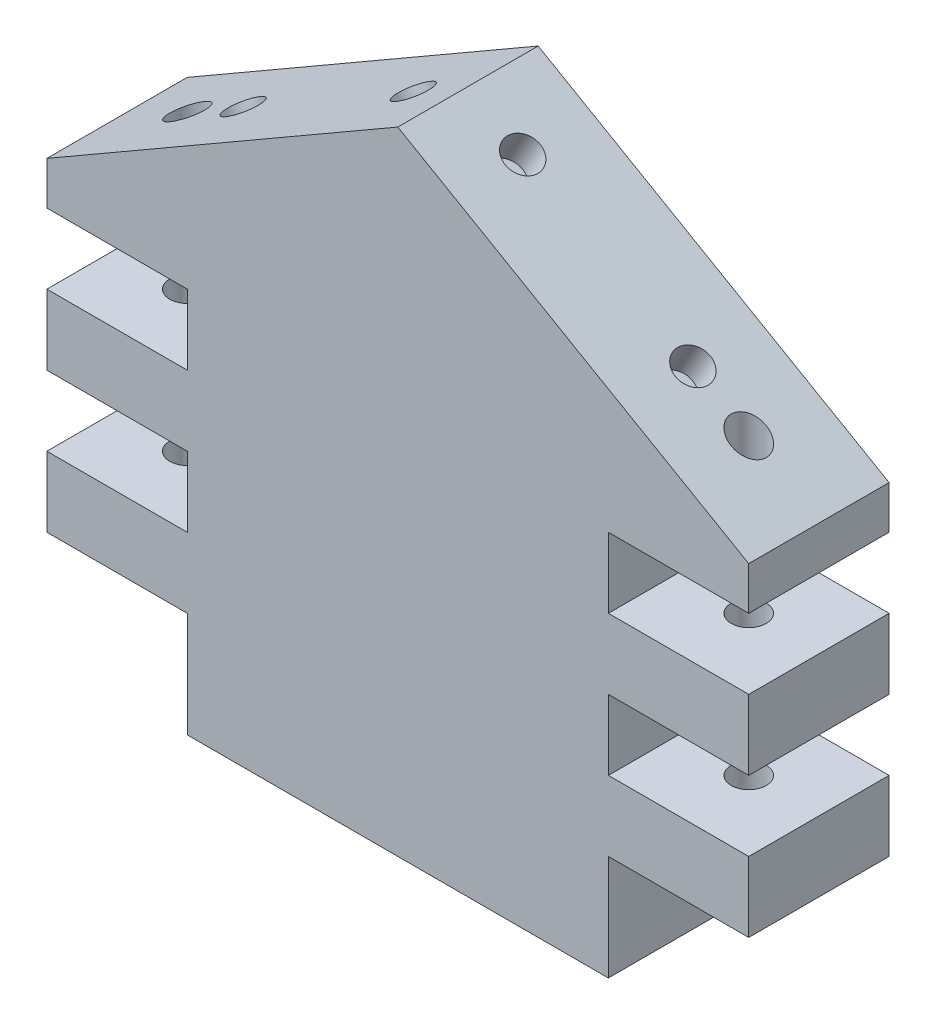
ISO-10303-21;
HEADER;
FILE_DESCRIPTION(('STEP AP214'),'2;1');
FILE_NAME('part.step','',(''),(''),'','','');
FILE_SCHEMA(('AUTOMOTIVE_DESIGN { 1 0 10303 214 1 1 1 1 }'));
ENDSEC;
DATA;
#1=APPLICATION_CONTEXT('core data for automotive mechanical design processes');
#2=APPLICATION_PROTOCOL_DEFINITION('international standard','automotive_design',2000,#1);
#3=PRODUCT_CONTEXT('',#1,'mechanical');
#4=PRODUCT('Part','Part','',(#3));
#5=PRODUCT_RELATED_PRODUCT_CATEGORY('part','',(#4));
#6=PRODUCT_DEFINITION_FORMATION('','',#4);
#7=PRODUCT_DEFINITION_CONTEXT('part definition',#1,'design');
#8=PRODUCT_DEFINITION('design','',#6,#7);
#9=PRODUCT_DEFINITION_SHAPE('','',#8);
#10=(LENGTH_UNIT() NAMED_UNIT(*) SI_UNIT(.MILLI.,.METRE.));
#11=(NAMED_UNIT(*) PLANE_ANGLE_UNIT() SI_UNIT($,.RADIAN.));
#12=(NAMED_UNIT(*) SI_UNIT($,.STERADIAN.) SOLID_ANGLE_UNIT());
#13=UNCERTAINTY_MEASURE_WITH_UNIT(LENGTH_MEASURE(1.E-05),#10,'distance_accuracy_value','');
#14=(GEOMETRIC_REPRESENTATION_CONTEXT(3) GLOBAL_UNCERTAINTY_ASSIGNED_CONTEXT((#13)) GLOBAL_UNIT_ASSIGNED_CONTEXT((#10,
#11,#12)) REPRESENTATION_CONTEXT('',''));
#15=CARTESIAN_POINT('',(0.,0.,0.));
#16=DIRECTION('',(0.,0.,1.));
#17=DIRECTION('',(1.,0.,0.));
#18=AXIS2_PLACEMENT_3D('',#15,#16,#17);
#19=CARTESIAN_POINT('',(-50.,16.1324865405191,-10.));
#20=DIRECTION('',(-0.499999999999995,0.866025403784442,0.));
#21=DIRECTION('',(-0.866025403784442,-0.499999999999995,0.));
#22=AXIS2_PLACEMENT_3D('',#19,#20,#21);
#23=PLANE('',#22);
#24=CARTESIAN_POINT('',(-7.79422863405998,40.5000000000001,0.));
#25=DIRECTION('',(0.499999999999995,-0.866025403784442,0.));
#26=DIRECTION('',(0.866025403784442,0.499999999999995,0.));
#27=AXIS2_PLACEMENT_3D('',#24,#25,#26);
#28=CIRCLE('',#27,2.5);
#29=CARTESIAN_POINT('',(-5.62916512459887,41.75,0.));
#30=VERTEX_POINT('',#29);
#31=EDGE_CURVE('E765',#30,#30,#28,.T.);
#32=ORIENTED_EDGE('',*,*,#31,.T.);
#33=EDGE_LOOP('',(#32));
#34=FACE_BOUND('',#33,.T.);
#35=DIRECTION('',(-0.866025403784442,-0.499999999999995,0.));
#36=VECTOR('',#35,1.);
#37=CARTESIAN_POINT('',(-50.,16.1324865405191,10.));
#38=LINE('',#37,#36);
#39=CARTESIAN_POINT('',(0.,45.,10.));
#40=VERTEX_POINT('',#39);
#41=CARTESIAN_POINT('',(-50.,16.1324865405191,10.));
#42=VERTEX_POINT('',#41);
#43=EDGE_CURVE('E213',#40,#42,#38,.T.);
#44=ORIENTED_EDGE('',*,*,#43,.F.);
#45=DIRECTION('',(0.,0.,1.));
#46=VECTOR('',#45,1.);
#47=CARTESIAN_POINT('',(0.,45.,-10.));
#48=LINE('',#47,#46);
#49=CARTESIAN_POINT('',(0.,45.,-10.));
#50=VERTEX_POINT('',#49);
#51=EDGE_CURVE('E208',#50,#40,#48,.T.);
#52=ORIENTED_EDGE('',*,*,#51,.F.);
#53=DIRECTION('',(-0.866025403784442,-0.499999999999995,0.));
#54=VECTOR('',#53,1.);
#55=CARTESIAN_POINT('',(-50.,16.1324865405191,-10.));
#56=LINE('',#55,#54);
#57=CARTESIAN_POINT('',(-50.,16.1324865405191,-10.));
#58=VERTEX_POINT('',#57);
#59=EDGE_CURVE('E202',#50,#58,#56,.T.);
#60=ORIENTED_EDGE('',*,*,#59,.T.);
#61=DIRECTION('',(0.,0.,1.));
#62=VECTOR('',#61,1.);
#63=CARTESIAN_POINT('',(-50.,16.1324865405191,-10.));
#64=LINE('',#63,#62);
#65=EDGE_CURVE('E205',#58,#42,#64,.T.);
#66=ORIENTED_EDGE('',*,*,#65,.T.);
#67=EDGE_LOOP('',(#44,#52,#60,#66));
#68=FACE_BOUND('',#67,.T.);
#69=CARTESIAN_POINT('',(-40.,21.9059892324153,0.));
#70=DIRECTION('',(-0.499999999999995,0.866025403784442,0.));
#71=DIRECTION('',(-0.866025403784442,-0.499999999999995,0.));
#72=AXIS2_PLACEMENT_3D('',#69,#70,#71);
#73=ELLIPSE('',#72,2.88675134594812,2.5);
#74=CARTESIAN_POINT('',(-42.5,20.4626135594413,0.));
#75=VERTEX_POINT('',#74);
#76=EDGE_CURVE('E37',#75,#75,#73,.F.);
#77=ORIENTED_EDGE('',*,*,#76,.T.);
#78=EDGE_LOOP('',(#77));
#79=FACE_BOUND('',#78,.T.);
#80=CARTESIAN_POINT('',(-32.0429399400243,26.5000000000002,0.));
#81=DIRECTION('',(0.499999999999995,-0.866025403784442,0.));
#82=DIRECTION('',(0.866025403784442,0.499999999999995,0.));
#83=AXIS2_PLACEMENT_3D('',#80,#81,#82);
#84=CIRCLE('',#83,2.5);
#85=CARTESIAN_POINT('',(-29.8778764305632,27.7500000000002,0.));
#86=VERTEX_POINT('',#85);
#87=EDGE_CURVE('E766',#86,#86,#84,.T.);
#88=ORIENTED_EDGE('',*,*,#87,.T.);
#89=EDGE_LOOP('',(#88));
#90=FACE_BOUND('',#89,.T.);
#91=ADVANCED_FACE('F33',(#34,#68,#79,#90),#23,.T.);
#92=CARTESIAN_POINT('',(-50.,-45.,10.));
#93=DIRECTION('',(1.,0.,0.));
#94=DIRECTION('',(0.,0.,-1.));
#95=AXIS2_PLACEMENT_3D('',#92,#93,#94);
#96=PLANE('',#95);
#97=ORIENTED_EDGE('',*,*,#65,.F.);
#98=DIRECTION('',(0.,-1.,0.));
#99=VECTOR('',#98,1.);
#100=CARTESIAN_POINT('',(-50.,-45.,-10.));
#101=LINE('',#100,#99);
#102=CARTESIAN_POINT('',(-50.,10.,-10.));
#103=VERTEX_POINT('',#102);
#104=EDGE_CURVE('E218',#58,#103,#101,.T.);
#105=ORIENTED_EDGE('',*,*,#104,.T.);
#106=DIRECTION('',(0.,0.,1.));
#107=VECTOR('',#106,1.);
#108=CARTESIAN_POINT('',(-50.,10.,-10.));
#109=LINE('',#108,#107);
#110=CARTESIAN_POINT('',(-50.,10.,10.));
#111=VERTEX_POINT('',#110);
#112=EDGE_CURVE('E491',#103,#111,#109,.T.);
#113=ORIENTED_EDGE('',*,*,#112,.T.);
#114=DIRECTION('',(0.,-1.,0.));
#115=VECTOR('',#114,1.);
#116=CARTESIAN_POINT('',(-50.,-45.,10.));
#117=LINE('',#116,#115);
#118=EDGE_CURVE('E220',#42,#111,#117,.T.);
#119=ORIENTED_EDGE('',*,*,#118,.F.);
#120=EDGE_LOOP('',(#97,#105,#113,#119));
#121=FACE_BOUND('',#120,.T.);
#122=ADVANCED_FACE('F35',(#121),#96,.F.);
#123=CARTESIAN_POINT('',(0.,0.,10.));
#124=DIRECTION('',(0.,0.,1.));
#125=DIRECTION('',(1.,0.,0.));
#126=AXIS2_PLACEMENT_3D('',#123,#124,#125);
#127=PLANE('',#126);
#128=DIRECTION('',(0.866025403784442,-0.499999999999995,0.));
#129=VECTOR('',#128,1.);
#130=CARTESIAN_POINT('',(50.,16.1324865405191,10.));
#131=LINE('',#130,#129);
#132=CARTESIAN_POINT('',(50.,16.1324865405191,10.));
#133=VERTEX_POINT('',#132);
#134=EDGE_CURVE('E440',#40,#133,#131,.T.);
#135=ORIENTED_EDGE('',*,*,#134,.F.);
#136=ORIENTED_EDGE('',*,*,#43,.T.);
#137=ORIENTED_EDGE('',*,*,#118,.T.);
#138=DIRECTION('',(1.,0.,0.));
#139=VECTOR('',#138,1.);
#140=CARTESIAN_POINT('',(-50.,10.,10.));
#141=LINE('',#140,#139);
#142=CARTESIAN_POINT('',(-30.,9.99999999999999,10.));
#143=VERTEX_POINT('',#142);
#144=EDGE_CURVE('E482',#111,#143,#141,.T.);
#145=ORIENTED_EDGE('',*,*,#144,.T.);
#146=DIRECTION('',(0.,-1.,0.));
#147=VECTOR('',#146,1.);
#148=CARTESIAN_POINT('',(-30.,9.99999999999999,10.));
#149=LINE('',#148,#147);
#150=CARTESIAN_POINT('',(-30.,0.,10.));
#151=VERTEX_POINT('',#150);
#152=EDGE_CURVE('E487',#143,#151,#149,.T.);
#153=ORIENTED_EDGE('',*,*,#152,.T.);
#154=DIRECTION('',(-1.,0.,0.));
#155=VECTOR('',#154,1.);
#156=CARTESIAN_POINT('',(-50.,0.,10.));
#157=LINE('',#156,#155);
#158=CARTESIAN_POINT('',(-50.,0.,10.));
#159=VERTEX_POINT('',#158);
#160=EDGE_CURVE('E403',#151,#159,#157,.T.);
#161=ORIENTED_EDGE('',*,*,#160,.T.);
#162=CARTESIAN_POINT('',(-50.,-10.,10.));
#163=VERTEX_POINT('',#162);
#164=EDGE_CURVE('E254',#159,#163,#117,.T.);
#165=ORIENTED_EDGE('',*,*,#164,.T.);
#166=DIRECTION('',(1.,0.,0.));
#167=VECTOR('',#166,1.);
#168=CARTESIAN_POINT('',(-50.,-10.,10.));
#169=LINE('',#168,#167);
#170=CARTESIAN_POINT('',(-30.,-10.,10.));
#171=VERTEX_POINT('',#170);
#172=EDGE_CURVE('E401',#163,#171,#169,.T.);
#173=ORIENTED_EDGE('',*,*,#172,.T.);
#174=DIRECTION('',(0.,-1.,0.));
#175=VECTOR('',#174,1.);
#176=CARTESIAN_POINT('',(-30.,-10.,10.));
#177=LINE('',#176,#175);
#178=CARTESIAN_POINT('',(-30.,-20.,10.));
#179=VERTEX_POINT('',#178);
#180=EDGE_CURVE('E416',#171,#179,#177,.T.);
#181=ORIENTED_EDGE('',*,*,#180,.T.);
#182=DIRECTION('',(-1.,0.,0.));
#183=VECTOR('',#182,1.);
#184=CARTESIAN_POINT('',(-50.,-20.,10.));
#185=LINE('',#184,#183);
#186=CARTESIAN_POINT('',(-50.,-20.,10.));
#187=VERTEX_POINT('',#186);
#188=EDGE_CURVE('E493',#179,#187,#185,.T.);
#189=ORIENTED_EDGE('',*,*,#188,.T.);
#190=CARTESIAN_POINT('',(-50.,-30.,10.));
#191=VERTEX_POINT('',#190);
#192=EDGE_CURVE('E255',#187,#191,#117,.T.);
#193=ORIENTED_EDGE('',*,*,#192,.T.);
#194=DIRECTION('',(1.,0.,0.));
#195=VECTOR('',#194,1.);
#196=CARTESIAN_POINT('',(-50.,-30.,10.));
#197=LINE('',#196,#195);
#198=CARTESIAN_POINT('',(-30.,-30.,10.));
#199=VERTEX_POINT('',#198);
#200=EDGE_CURVE('E422',#191,#199,#197,.T.);
#201=ORIENTED_EDGE('',*,*,#200,.T.);
#202=DIRECTION('',(0.,-1.,0.));
#203=VECTOR('',#202,1.);
#204=CARTESIAN_POINT('',(-30.,-30.,10.));
#205=LINE('',#204,#203);
#206=CARTESIAN_POINT('',(-30.,-45.,10.));
#207=VERTEX_POINT('',#206);
#208=EDGE_CURVE('E420',#199,#207,#205,.T.);
#209=ORIENTED_EDGE('',*,*,#208,.T.);
#210=DIRECTION('',(1.,0.,0.));
#211=VECTOR('',#210,1.);
#212=CARTESIAN_POINT('',(50.,-45.,10.));
#213=LINE('',#212,#211);
#214=CARTESIAN_POINT('',(30.,-45.,10.));
#215=VERTEX_POINT('',#214);
#216=EDGE_CURVE('E253',#207,#215,#213,.T.);
#217=ORIENTED_EDGE('',*,*,#216,.T.);
#218=DIRECTION('',(0.,-1.,0.));
#219=VECTOR('',#218,1.);
#220=CARTESIAN_POINT('',(30.,-30.,10.));
#221=LINE('',#220,#219);
#222=CARTESIAN_POINT('',(30.,-30.,10.));
#223=VERTEX_POINT('',#222);
#224=EDGE_CURVE('E247',#223,#215,#221,.T.);
#225=ORIENTED_EDGE('',*,*,#224,.F.);
#226=DIRECTION('',(-1.,0.,0.));
#227=VECTOR('',#226,1.);
#228=CARTESIAN_POINT('',(50.,-30.,10.));
#229=LINE('',#228,#227);
#230=CARTESIAN_POINT('',(50.,-30.,10.));
#231=VERTEX_POINT('',#230);
#232=EDGE_CURVE('E315',#231,#223,#229,.T.);
#233=ORIENTED_EDGE('',*,*,#232,.F.);
#234=DIRECTION('',(0.,1.,0.));
#235=VECTOR('',#234,1.);
#236=CARTESIAN_POINT('',(50.,-45.,10.));
#237=LINE('',#236,#235);
#238=CARTESIAN_POINT('',(50.,-20.,10.));
#239=VERTEX_POINT('',#238);
#240=EDGE_CURVE('E11',#231,#239,#237,.T.);
#241=ORIENTED_EDGE('',*,*,#240,.T.);
#242=DIRECTION('',(1.,0.,0.));
#243=VECTOR('',#242,1.);
#244=CARTESIAN_POINT('',(50.,-20.,10.));
#245=LINE('',#244,#243);
#246=CARTESIAN_POINT('',(30.,-20.,10.));
#247=VERTEX_POINT('',#246);
#248=EDGE_CURVE('E303',#247,#239,#245,.T.);
#249=ORIENTED_EDGE('',*,*,#248,.F.);
#250=DIRECTION('',(0.,-1.,0.));
#251=VECTOR('',#250,1.);
#252=CARTESIAN_POINT('',(30.,-10.,10.));
#253=LINE('',#252,#251);
#254=CARTESIAN_POINT('',(30.,-10.,10.));
#255=VERTEX_POINT('',#254);
#256=EDGE_CURVE('E288',#255,#247,#253,.T.);
#257=ORIENTED_EDGE('',*,*,#256,.F.);
#258=DIRECTION('',(-1.,0.,0.));
#259=VECTOR('',#258,1.);
#260=CARTESIAN_POINT('',(50.,-10.,10.));
#261=LINE('',#260,#259);
#262=CARTESIAN_POINT('',(50.,-10.,10.));
#263=VERTEX_POINT('',#262);
#264=EDGE_CURVE('E273',#263,#255,#261,.T.);
#265=ORIENTED_EDGE('',*,*,#264,.F.);
#266=CARTESIAN_POINT('',(50.,0.,10.));
#267=VERTEX_POINT('',#266);
#268=EDGE_CURVE('E42',#263,#267,#237,.T.);
#269=ORIENTED_EDGE('',*,*,#268,.T.);
#270=DIRECTION('',(1.,0.,0.));
#271=VECTOR('',#270,1.);
#272=CARTESIAN_POINT('',(50.,0.,10.));
#273=LINE('',#272,#271);
#274=CARTESIAN_POINT('',(30.,0.,10.));
#275=VERTEX_POINT('',#274);
#276=EDGE_CURVE('E270',#275,#267,#273,.T.);
#277=ORIENTED_EDGE('',*,*,#276,.F.);
#278=DIRECTION('',(0.,-1.,0.));
#279=VECTOR('',#278,1.);
#280=CARTESIAN_POINT('',(30.,9.99999999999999,10.));
#281=LINE('',#280,#279);
#282=CARTESIAN_POINT('',(30.,9.99999999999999,10.));
#283=VERTEX_POINT('',#282);
#284=EDGE_CURVE('E375',#283,#275,#281,.T.);
#285=ORIENTED_EDGE('',*,*,#284,.F.);
#286=DIRECTION('',(-1.,0.,0.));
#287=VECTOR('',#286,1.);
#288=CARTESIAN_POINT('',(50.,10.,10.));
#289=LINE('',#288,#287);
#290=CARTESIAN_POINT('',(50.,10.,10.));
#291=VERTEX_POINT('',#290);
#292=EDGE_CURVE('E360',#291,#283,#289,.T.);
#293=ORIENTED_EDGE('',*,*,#292,.F.);
#294=EDGE_CURVE('E44',#291,#133,#237,.T.);
#295=ORIENTED_EDGE('',*,*,#294,.T.);
#296=EDGE_LOOP('',(#135,#136,#137,#145,#153,#161,#165,#173,#181,#189,#193,#201,#209,#217,#225,
#233,#241,#249,#257,#265,#269,#277,#285,#293,#295));
#297=FACE_BOUND('',#296,.T.);
#298=ADVANCED_FACE('F268',(#297),#127,.T.);
#299=CARTESIAN_POINT('',(0.,0.,-10.));
#300=DIRECTION('',(0.,0.,1.));
#301=DIRECTION('',(1.,0.,0.));
#302=AXIS2_PLACEMENT_3D('',#299,#300,#301);
#303=PLANE('',#302);
#304=ORIENTED_EDGE('',*,*,#59,.F.);
#305=DIRECTION('',(0.866025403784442,-0.499999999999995,0.));
#306=VECTOR('',#305,1.);
#307=CARTESIAN_POINT('',(50.,16.1324865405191,-10.));
#308=LINE('',#307,#306);
#309=CARTESIAN_POINT('',(50.,16.1324865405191,-10.));
#310=VERTEX_POINT('',#309);
#311=EDGE_CURVE('E387',#50,#310,#308,.T.);
#312=ORIENTED_EDGE('',*,*,#311,.T.);
#313=DIRECTION('',(0.,1.,0.));
#314=VECTOR('',#313,1.);
#315=CARTESIAN_POINT('',(50.,-45.,-10.));
#316=LINE('',#315,#314);
#317=CARTESIAN_POINT('',(50.,10.,-10.));
#318=VERTEX_POINT('',#317);
#319=EDGE_CURVE('E230',#318,#310,#316,.T.);
#320=ORIENTED_EDGE('',*,*,#319,.F.);
#321=DIRECTION('',(-1.,0.,0.));
#322=VECTOR('',#321,1.);
#323=CARTESIAN_POINT('',(50.,10.,-10.));
#324=LINE('',#323,#322);
#325=CARTESIAN_POINT('',(30.,9.99999999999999,-10.));
#326=VERTEX_POINT('',#325);
#327=EDGE_CURVE('E367',#318,#326,#324,.T.);
#328=ORIENTED_EDGE('',*,*,#327,.T.);
#329=DIRECTION('',(0.,-1.,0.));
#330=VECTOR('',#329,1.);
#331=CARTESIAN_POINT('',(30.,9.99999999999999,-10.));
#332=LINE('',#331,#330);
#333=CARTESIAN_POINT('',(30.,0.,-10.));
#334=VERTEX_POINT('',#333);
#335=EDGE_CURVE('E370',#326,#334,#332,.T.);
#336=ORIENTED_EDGE('',*,*,#335,.T.);
#337=DIRECTION('',(1.,0.,0.));
#338=VECTOR('',#337,1.);
#339=CARTESIAN_POINT('',(50.,0.,-10.));
#340=LINE('',#339,#338);
#341=CARTESIAN_POINT('',(50.,0.,-10.));
#342=VERTEX_POINT('',#341);
#343=EDGE_CURVE('E298',#334,#342,#340,.T.);
#344=ORIENTED_EDGE('',*,*,#343,.T.);
#345=CARTESIAN_POINT('',(50.,-10.,-10.));
#346=VERTEX_POINT('',#345);
#347=EDGE_CURVE('E282',#346,#342,#316,.T.);
#348=ORIENTED_EDGE('',*,*,#347,.F.);
#349=DIRECTION('',(-1.,0.,0.));
#350=VECTOR('',#349,1.);
#351=CARTESIAN_POINT('',(50.,-10.,-10.));
#352=LINE('',#351,#350);
#353=CARTESIAN_POINT('',(30.,-10.,-10.));
#354=VERTEX_POINT('',#353);
#355=EDGE_CURVE('E299',#346,#354,#352,.T.);
#356=ORIENTED_EDGE('',*,*,#355,.T.);
#357=DIRECTION('',(0.,-1.,0.));
#358=VECTOR('',#357,1.);
#359=CARTESIAN_POINT('',(30.,-10.,-10.));
#360=LINE('',#359,#358);
#361=CARTESIAN_POINT('',(30.,-20.,-10.));
#362=VERTEX_POINT('',#361);
#363=EDGE_CURVE('E302',#354,#362,#360,.T.);
#364=ORIENTED_EDGE('',*,*,#363,.T.);
#365=DIRECTION('',(1.,0.,0.));
#366=VECTOR('',#365,1.);
#367=CARTESIAN_POINT('',(50.,-20.,-10.));
#368=LINE('',#367,#366);
#369=CARTESIAN_POINT('',(50.,-20.,-10.));
#370=VERTEX_POINT('',#369);
#371=EDGE_CURVE('E306',#362,#370,#368,.T.);
#372=ORIENTED_EDGE('',*,*,#371,.T.);
#373=CARTESIAN_POINT('',(50.,-30.,-10.));
#374=VERTEX_POINT('',#373);
#375=EDGE_CURVE('E338',#374,#370,#316,.T.);
#376=ORIENTED_EDGE('',*,*,#375,.F.);
#377=DIRECTION('',(-1.,0.,0.));
#378=VECTOR('',#377,1.);
#379=CARTESIAN_POINT('',(50.,-30.,-10.));
#380=LINE('',#379,#378);
#381=CARTESIAN_POINT('',(30.,-30.,-10.));
#382=VERTEX_POINT('',#381);
#383=EDGE_CURVE('E321',#374,#382,#380,.T.);
#384=ORIENTED_EDGE('',*,*,#383,.T.);
#385=DIRECTION('',(0.,-1.,0.));
#386=VECTOR('',#385,1.);
#387=CARTESIAN_POINT('',(30.,-30.,-10.));
#388=LINE('',#387,#386);
#389=CARTESIAN_POINT('',(30.,-45.,-10.));
#390=VERTEX_POINT('',#389);
#391=EDGE_CURVE('E251',#382,#390,#388,.T.);
#392=ORIENTED_EDGE('',*,*,#391,.T.);
#393=DIRECTION('',(1.,0.,0.));
#394=VECTOR('',#393,1.);
#395=CARTESIAN_POINT('',(50.,-45.,-10.));
#396=LINE('',#395,#394);
#397=CARTESIAN_POINT('',(-30.,-45.,-10.));
#398=VERTEX_POINT('',#397);
#399=EDGE_CURVE('E226',#398,#390,#396,.T.);
#400=ORIENTED_EDGE('',*,*,#399,.F.);
#401=DIRECTION('',(0.,-1.,0.));
#402=VECTOR('',#401,1.);
#403=CARTESIAN_POINT('',(-30.,-30.,-10.));
#404=LINE('',#403,#402);
#405=CARTESIAN_POINT('',(-30.,-30.,-10.));
#406=VERTEX_POINT('',#405);
#407=EDGE_CURVE('E431',#406,#398,#404,.T.);
#408=ORIENTED_EDGE('',*,*,#407,.F.);
#409=DIRECTION('',(1.,0.,0.));
#410=VECTOR('',#409,1.);
#411=CARTESIAN_POINT('',(-50.,-30.,-10.));
#412=LINE('',#411,#410);
#413=CARTESIAN_POINT('',(-50.,-30.,-10.));
#414=VERTEX_POINT('',#413);
#415=EDGE_CURVE('E433',#414,#406,#412,.T.);
#416=ORIENTED_EDGE('',*,*,#415,.F.);
#417=CARTESIAN_POINT('',(-50.,-20.,-10.));
#418=VERTEX_POINT('',#417);
#419=EDGE_CURVE('E229',#418,#414,#101,.T.);
#420=ORIENTED_EDGE('',*,*,#419,.F.);
#421=DIRECTION('',(-1.,0.,0.));
#422=VECTOR('',#421,1.);
#423=CARTESIAN_POINT('',(-50.,-20.,-10.));
#424=LINE('',#423,#422);
#425=CARTESIAN_POINT('',(-30.,-20.,-10.));
#426=VERTEX_POINT('',#425);
#427=EDGE_CURVE('E415',#426,#418,#424,.T.);
#428=ORIENTED_EDGE('',*,*,#427,.F.);
#429=DIRECTION('',(0.,-1.,0.));
#430=VECTOR('',#429,1.);
#431=CARTESIAN_POINT('',(-30.,-10.,-10.));
#432=LINE('',#431,#430);
#433=CARTESIAN_POINT('',(-30.,-10.,-10.));
#434=VERTEX_POINT('',#433);
#435=EDGE_CURVE('E499',#434,#426,#432,.T.);
#436=ORIENTED_EDGE('',*,*,#435,.F.);
#437=DIRECTION('',(1.,0.,0.));
#438=VECTOR('',#437,1.);
#439=CARTESIAN_POINT('',(-50.,-10.,-10.));
#440=LINE('',#439,#438);
#441=CARTESIAN_POINT('',(-50.,-10.,-10.));
#442=VERTEX_POINT('',#441);
#443=EDGE_CURVE('E430',#442,#434,#440,.T.);
#444=ORIENTED_EDGE('',*,*,#443,.F.);
#445=CARTESIAN_POINT('',(-50.,0.,-10.));
#446=VERTEX_POINT('',#445);
#447=EDGE_CURVE('E227',#446,#442,#101,.T.);
#448=ORIENTED_EDGE('',*,*,#447,.F.);
#449=DIRECTION('',(-1.,0.,0.));
#450=VECTOR('',#449,1.);
#451=CARTESIAN_POINT('',(-50.,0.,-10.));
#452=LINE('',#451,#450);
#453=CARTESIAN_POINT('',(-30.,0.,-10.));
#454=VERTEX_POINT('',#453);
#455=EDGE_CURVE('E479',#454,#446,#452,.T.);
#456=ORIENTED_EDGE('',*,*,#455,.F.);
#457=DIRECTION('',(0.,-1.,0.));
#458=VECTOR('',#457,1.);
#459=CARTESIAN_POINT('',(-30.,9.99999999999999,-10.));
#460=LINE('',#459,#458);
#461=CARTESIAN_POINT('',(-30.,9.99999999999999,-10.));
#462=VERTEX_POINT('',#461);
#463=EDGE_CURVE('E481',#462,#454,#460,.T.);
#464=ORIENTED_EDGE('',*,*,#463,.F.);
#465=DIRECTION('',(1.,0.,0.));
#466=VECTOR('',#465,1.);
#467=CARTESIAN_POINT('',(-50.,10.,-10.));
#468=LINE('',#467,#466);
#469=EDGE_CURVE('E225',#103,#462,#468,.T.);
#470=ORIENTED_EDGE('',*,*,#469,.F.);
#471=ORIENTED_EDGE('',*,*,#104,.F.);
#472=EDGE_LOOP('',(#304,#312,#320,#328,#336,#344,#348,#356,#364,#372,#376,#384,#392,#400,#408,
#416,#420,#428,#436,#444,#448,#456,#464,#470,#471));
#473=FACE_BOUND('',#472,.T.);
#474=ADVANCED_FACE('F223',(#473),#303,.F.);
#475=CARTESIAN_POINT('',(-40.,45.,0.));
#476=DIRECTION('',(0.,-1.,0.));
#477=DIRECTION('',(1.,0.,0.));
#478=AXIS2_PLACEMENT_3D('',#475,#476,#477);
#479=CYLINDRICAL_SURFACE('',#478,2.5);
#480=CARTESIAN_POINT('',(-40.,10.,0.));
#481=DIRECTION('',(0.,-1.,0.));
#482=DIRECTION('',(1.,0.,0.));
#483=AXIS2_PLACEMENT_3D('',#480,#481,#482);
#484=CIRCLE('',#483,2.5);
#485=CARTESIAN_POINT('',(-37.5,10.,0.));
#486=VERTEX_POINT('',#485);
#487=EDGE_CURVE('E460',#486,#486,#484,.T.);
#488=ORIENTED_EDGE('',*,*,#487,.T.);
#489=EDGE_LOOP('',(#488));
#490=FACE_BOUND('',#489,.T.);
#491=ORIENTED_EDGE('',*,*,#76,.F.);
#492=EDGE_LOOP('',(#491));
#493=FACE_BOUND('',#492,.T.);
#494=ADVANCED_FACE('F545',(#490,#493),#479,.F.);
#495=DIRECTION('',(0.,0.,1.));
#496=VECTOR('',#495,1.);
#497=CARTESIAN_POINT('',(-50.,0.,-10.));
#498=LINE('',#497,#496);
#499=EDGE_CURVE('E485',#446,#159,#498,.T.);
#500=ORIENTED_EDGE('',*,*,#499,.F.);
#501=ORIENTED_EDGE('',*,*,#447,.T.);
#502=DIRECTION('',(0.,0.,1.));
#503=VECTOR('',#502,1.);
#504=CARTESIAN_POINT('',(-50.,-10.,-10.));
#505=LINE('',#504,#503);
#506=EDGE_CURVE('E410',#442,#163,#505,.T.);
#507=ORIENTED_EDGE('',*,*,#506,.T.);
#508=ORIENTED_EDGE('',*,*,#164,.F.);
#509=EDGE_LOOP('',(#500,#501,#507,#508));
#510=FACE_BOUND('',#509,.T.);
#511=ADVANCED_FACE('F418',(#510),#96,.F.);
#512=DIRECTION('',(0.,0.,1.));
#513=VECTOR('',#512,1.);
#514=CARTESIAN_POINT('',(-50.,-20.,-10.));
#515=LINE('',#514,#513);
#516=EDGE_CURVE('E428',#418,#187,#515,.T.);
#517=ORIENTED_EDGE('',*,*,#516,.F.);
#518=ORIENTED_EDGE('',*,*,#419,.T.);
#519=DIRECTION('',(0.,0.,1.));
#520=VECTOR('',#519,1.);
#521=CARTESIAN_POINT('',(-50.,-30.,-10.));
#522=LINE('',#521,#520);
#523=EDGE_CURVE('E438',#414,#191,#522,.T.);
#524=ORIENTED_EDGE('',*,*,#523,.T.);
#525=ORIENTED_EDGE('',*,*,#192,.F.);
#526=EDGE_LOOP('',(#517,#518,#524,#525));
#527=FACE_BOUND('',#526,.T.);
#528=ADVANCED_FACE('F507',(#527),#96,.F.);
#529=CARTESIAN_POINT('',(50.,-45.,10.));
#530=DIRECTION('',(0.,1.,0.));
#531=DIRECTION('',(-1.,0.,0.));
#532=AXIS2_PLACEMENT_3D('',#529,#530,#531);
#533=PLANE('',#532);
#534=DIRECTION('',(0.,0.,1.));
#535=VECTOR('',#534,1.);
#536=CARTESIAN_POINT('',(-30.,-45.,-10.));
#537=LINE('',#536,#535);
#538=EDGE_CURVE('E435',#398,#207,#537,.T.);
#539=ORIENTED_EDGE('',*,*,#538,.F.);
#540=ORIENTED_EDGE('',*,*,#399,.T.);
#541=DIRECTION('',(0.,0.,1.));
#542=VECTOR('',#541,1.);
#543=CARTESIAN_POINT('',(30.,-45.,-10.));
#544=LINE('',#543,#542);
#545=EDGE_CURVE('E232',#390,#215,#544,.T.);
#546=ORIENTED_EDGE('',*,*,#545,.T.);
#547=ORIENTED_EDGE('',*,*,#216,.F.);
#548=EDGE_LOOP('',(#539,#540,#546,#547));
#549=FACE_BOUND('',#548,.T.);
#550=ADVANCED_FACE('F516',(#549),#533,.F.);
#551=CARTESIAN_POINT('',(50.,-30.,-10.));
#552=DIRECTION('',(0.,1.,0.));
#553=DIRECTION('',(0.,0.,1.));
#554=AXIS2_PLACEMENT_3D('',#551,#552,#553);
#555=PLANE('',#554);
#556=ORIENTED_EDGE('',*,*,#232,.T.);
#557=DIRECTION('',(0.,0.,1.));
#558=VECTOR('',#557,1.);
#559=CARTESIAN_POINT('',(30.,-30.,-10.));
#560=LINE('',#559,#558);
#561=EDGE_CURVE('E239',#382,#223,#560,.T.);
#562=ORIENTED_EDGE('',*,*,#561,.F.);
#563=ORIENTED_EDGE('',*,*,#383,.F.);
#564=DIRECTION('',(0.,0.,1.));
#565=VECTOR('',#564,1.);
#566=CARTESIAN_POINT('',(50.,-30.,-10.));
#567=LINE('',#566,#565);
#568=EDGE_CURVE('E244',#374,#231,#567,.T.);
#569=ORIENTED_EDGE('',*,*,#568,.T.);
#570=EDGE_LOOP('',(#556,#562,#563,#569));
#571=FACE_BOUND('',#570,.T.);
#572=CARTESIAN_POINT('',(40.,-30.,0.));
#573=DIRECTION('',(0.,1.,0.));
#574=DIRECTION('',(-1.,0.,0.));
#575=AXIS2_PLACEMENT_3D('',#572,#573,#574);
#576=CIRCLE('',#575,2.5);
#577=CARTESIAN_POINT('',(37.5,-30.,0.));
#578=VERTEX_POINT('',#577);
#579=EDGE_CURVE('E449',#578,#578,#576,.T.);
#580=ORIENTED_EDGE('',*,*,#579,.T.);
#581=EDGE_LOOP('',(#580));
#582=FACE_BOUND('',#581,.T.);
#583=ADVANCED_FACE('F517',(#571,#582),#555,.F.);
#584=CARTESIAN_POINT('',(50.,-20.,-10.));
#585=DIRECTION('',(0.,-1.,0.));
#586=DIRECTION('',(0.,0.,-1.));
#587=AXIS2_PLACEMENT_3D('',#584,#585,#586);
#588=PLANE('',#587);
#589=ORIENTED_EDGE('',*,*,#248,.T.);
#590=DIRECTION('',(0.,0.,1.));
#591=VECTOR('',#590,1.);
#592=CARTESIAN_POINT('',(50.,-20.,-10.));
#593=LINE('',#592,#591);
#594=EDGE_CURVE('E312',#370,#239,#593,.T.);
#595=ORIENTED_EDGE('',*,*,#594,.F.);
#596=ORIENTED_EDGE('',*,*,#371,.F.);
#597=DIRECTION('',(0.,0.,1.));
#598=VECTOR('',#597,1.);
#599=CARTESIAN_POINT('',(30.,-20.,-10.));
#600=LINE('',#599,#598);
#601=EDGE_CURVE('E316',#362,#247,#600,.T.);
#602=ORIENTED_EDGE('',*,*,#601,.T.);
#603=EDGE_LOOP('',(#589,#595,#596,#602));
#604=FACE_BOUND('',#603,.T.);
#605=CARTESIAN_POINT('',(40.,-20.,0.));
#606=DIRECTION('',(0.,-1.,0.));
#607=DIRECTION('',(0.,0.,-1.));
#608=AXIS2_PLACEMENT_3D('',#605,#606,#607);
#609=CIRCLE('',#608,2.5);
#610=CARTESIAN_POINT('',(40.,-20.,-2.5));
#611=VERTEX_POINT('',#610);
#612=EDGE_CURVE('E356',#611,#611,#609,.F.);
#613=ORIENTED_EDGE('',*,*,#612,.F.);
#614=EDGE_LOOP('',(#613));
#615=FACE_BOUND('',#614,.T.);
#616=ADVANCED_FACE('F341',(#604,#615),#588,.F.);
#617=CARTESIAN_POINT('',(50.,-10.,-10.));
#618=DIRECTION('',(0.,1.,0.));
#619=DIRECTION('',(-1.,0.,0.));
#620=AXIS2_PLACEMENT_3D('',#617,#618,#619);
#621=PLANE('',#620);
#622=ORIENTED_EDGE('',*,*,#264,.T.);
#623=DIRECTION('',(0.,0.,1.));
#624=VECTOR('',#623,1.);
#625=CARTESIAN_POINT('',(30.,-10.,-10.));
#626=LINE('',#625,#624);
#627=EDGE_CURVE('E318',#354,#255,#626,.T.);
#628=ORIENTED_EDGE('',*,*,#627,.F.);
#629=ORIENTED_EDGE('',*,*,#355,.F.);
#630=DIRECTION('',(0.,0.,1.));
#631=VECTOR('',#630,1.);
#632=CARTESIAN_POINT('',(50.,-10.,-10.));
#633=LINE('',#632,#631);
#634=EDGE_CURVE('E279',#346,#263,#633,.T.);
#635=ORIENTED_EDGE('',*,*,#634,.T.);
#636=EDGE_LOOP('',(#622,#628,#629,#635));
#637=FACE_BOUND('',#636,.T.);
#638=CARTESIAN_POINT('',(40.,-10.,0.));
#639=DIRECTION('',(0.,1.,0.));
#640=DIRECTION('',(-1.,0.,0.));
#641=AXIS2_PLACEMENT_3D('',#638,#639,#640);
#642=CIRCLE('',#641,2.5);
#643=CARTESIAN_POINT('',(37.5,-10.,0.));
#644=VERTEX_POINT('',#643);
#645=EDGE_CURVE('E354',#644,#644,#642,.F.);
#646=ORIENTED_EDGE('',*,*,#645,.F.);
#647=EDGE_LOOP('',(#646));
#648=FACE_BOUND('',#647,.T.);
#649=ADVANCED_FACE('F347',(#637,#648),#621,.F.);
#650=CARTESIAN_POINT('',(50.,0.,-10.));
#651=DIRECTION('',(0.,-1.,0.));
#652=DIRECTION('',(0.,0.,-1.));
#653=AXIS2_PLACEMENT_3D('',#650,#651,#652);
#654=PLANE('',#653);
#655=ORIENTED_EDGE('',*,*,#276,.T.);
#656=DIRECTION('',(0.,0.,1.));
#657=VECTOR('',#656,1.);
#658=CARTESIAN_POINT('',(50.,0.,-10.));
#659=LINE('',#658,#657);
#660=EDGE_CURVE('E281',#342,#267,#659,.T.);
#661=ORIENTED_EDGE('',*,*,#660,.F.);
#662=ORIENTED_EDGE('',*,*,#343,.F.);
#663=DIRECTION('',(0.,0.,1.));
#664=VECTOR('',#663,1.);
#665=CARTESIAN_POINT('',(30.,0.,-10.));
#666=LINE('',#665,#664);
#667=EDGE_CURVE('E286',#334,#275,#666,.T.);
#668=ORIENTED_EDGE('',*,*,#667,.T.);
#669=EDGE_LOOP('',(#655,#661,#662,#668));
#670=FACE_BOUND('',#669,.T.);
#671=CARTESIAN_POINT('',(40.,0.,0.));
#672=DIRECTION('',(0.,-1.,0.));
#673=DIRECTION('',(0.,0.,-1.));
#674=AXIS2_PLACEMENT_3D('',#671,#672,#673);
#675=CIRCLE('',#674,2.5);
#676=CARTESIAN_POINT('',(40.,0.,-2.5));
#677=VERTEX_POINT('',#676);
#678=EDGE_CURVE('E357',#677,#677,#675,.F.);
#679=ORIENTED_EDGE('',*,*,#678,.F.);
#680=EDGE_LOOP('',(#679));
#681=FACE_BOUND('',#680,.T.);
#682=ADVANCED_FACE('F350',(#670,#681),#654,.F.);
#683=CARTESIAN_POINT('',(50.,10.,-10.));
#684=DIRECTION('',(0.,1.,0.));
#685=DIRECTION('',(-1.,0.,0.));
#686=AXIS2_PLACEMENT_3D('',#683,#684,#685);
#687=PLANE('',#686);
#688=ORIENTED_EDGE('',*,*,#292,.T.);
#689=DIRECTION('',(0.,0.,1.));
#690=VECTOR('',#689,1.);
#691=CARTESIAN_POINT('',(30.,9.99999999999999,-10.));
#692=LINE('',#691,#690);
#693=EDGE_CURVE('E290',#326,#283,#692,.T.);
#694=ORIENTED_EDGE('',*,*,#693,.F.);
#695=ORIENTED_EDGE('',*,*,#327,.F.);
#696=DIRECTION('',(0.,0.,1.));
#697=VECTOR('',#696,1.);
#698=CARTESIAN_POINT('',(50.,10.,-10.));
#699=LINE('',#698,#697);
#700=EDGE_CURVE('E296',#318,#291,#699,.T.);
#701=ORIENTED_EDGE('',*,*,#700,.T.);
#702=EDGE_LOOP('',(#688,#694,#695,#701));
#703=FACE_BOUND('',#702,.T.);
#704=CARTESIAN_POINT('',(40.,10.,0.));
#705=DIRECTION('',(0.,1.,0.));
#706=DIRECTION('',(-1.,0.,0.));
#707=AXIS2_PLACEMENT_3D('',#704,#705,#706);
#708=CIRCLE('',#707,2.5);
#709=CARTESIAN_POINT('',(37.5,10.,0.));
#710=VERTEX_POINT('',#709);
#711=EDGE_CURVE('E363',#710,#710,#708,.F.);
#712=ORIENTED_EDGE('',*,*,#711,.F.);
#713=EDGE_LOOP('',(#712));
#714=FACE_BOUND('',#713,.T.);
#715=ADVANCED_FACE('F382',(#703,#714),#687,.F.);
#716=CARTESIAN_POINT('',(50.,-45.,10.));
#717=DIRECTION('',(-1.,0.,0.));
#718=DIRECTION('',(0.,0.,1.));
#719=AXIS2_PLACEMENT_3D('',#716,#717,#718);
#720=PLANE('',#719);
#721=ORIENTED_EDGE('',*,*,#347,.T.);
#722=ORIENTED_EDGE('',*,*,#660,.T.);
#723=ORIENTED_EDGE('',*,*,#268,.F.);
#724=ORIENTED_EDGE('',*,*,#634,.F.);
#725=EDGE_LOOP('',(#721,#722,#723,#724));
#726=FACE_BOUND('',#725,.T.);
#727=ADVANCED_FACE('F278',(#726),#720,.F.);
#728=ORIENTED_EDGE('',*,*,#375,.T.);
#729=ORIENTED_EDGE('',*,*,#594,.T.);
#730=ORIENTED_EDGE('',*,*,#240,.F.);
#731=ORIENTED_EDGE('',*,*,#568,.F.);
#732=EDGE_LOOP('',(#728,#729,#730,#731));
#733=FACE_BOUND('',#732,.T.);
#734=ADVANCED_FACE('F336',(#733),#720,.F.);
#735=ORIENTED_EDGE('',*,*,#319,.T.);
#736=DIRECTION('',(0.,0.,1.));
#737=VECTOR('',#736,1.);
#738=CARTESIAN_POINT('',(50.,16.1324865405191,-10.));
#739=LINE('',#738,#737);
#740=EDGE_CURVE('E446',#310,#133,#739,.T.);
#741=ORIENTED_EDGE('',*,*,#740,.T.);
#742=ORIENTED_EDGE('',*,*,#294,.F.);
#743=ORIENTED_EDGE('',*,*,#700,.F.);
#744=EDGE_LOOP('',(#735,#741,#742,#743));
#745=FACE_BOUND('',#744,.T.);
#746=ADVANCED_FACE('F590',(#745),#720,.F.);
#747=CARTESIAN_POINT('',(30.,-30.,-10.));
#748=DIRECTION('',(-1.,0.,0.));
#749=DIRECTION('',(0.,-1.,0.));
#750=AXIS2_PLACEMENT_3D('',#747,#748,#749);
#751=PLANE('',#750);
#752=ORIENTED_EDGE('',*,*,#224,.T.);
#753=ORIENTED_EDGE('',*,*,#545,.F.);
#754=ORIENTED_EDGE('',*,*,#391,.F.);
#755=ORIENTED_EDGE('',*,*,#561,.T.);
#756=EDGE_LOOP('',(#752,#753,#754,#755));
#757=FACE_BOUND('',#756,.T.);
#758=ADVANCED_FACE('F330',(#757),#751,.F.);
#759=CARTESIAN_POINT('',(30.,-10.,-10.));
#760=DIRECTION('',(-1.,0.,0.));
#761=DIRECTION('',(0.,0.,1.));
#762=AXIS2_PLACEMENT_3D('',#759,#760,#761);
#763=PLANE('',#762);
#764=ORIENTED_EDGE('',*,*,#256,.T.);
#765=ORIENTED_EDGE('',*,*,#601,.F.);
#766=ORIENTED_EDGE('',*,*,#363,.F.);
#767=ORIENTED_EDGE('',*,*,#627,.T.);
#768=EDGE_LOOP('',(#764,#765,#766,#767));
#769=FACE_BOUND('',#768,.T.);
#770=ADVANCED_FACE('F345',(#769),#763,.F.);
#771=CARTESIAN_POINT('',(30.,9.99999999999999,-10.));
#772=DIRECTION('',(-1.,0.,0.));
#773=DIRECTION('',(0.,0.,1.));
#774=AXIS2_PLACEMENT_3D('',#771,#772,#773);
#775=PLANE('',#774);
#776=ORIENTED_EDGE('',*,*,#284,.T.);
#777=ORIENTED_EDGE('',*,*,#667,.F.);
#778=ORIENTED_EDGE('',*,*,#335,.F.);
#779=ORIENTED_EDGE('',*,*,#693,.T.);
#780=EDGE_LOOP('',(#776,#777,#778,#779));
#781=FACE_BOUND('',#780,.T.);
#782=ADVANCED_FACE('F379',(#781),#775,.F.);
#783=CARTESIAN_POINT('',(40.,45.,0.));
#784=DIRECTION('',(0.,-1.,0.));
#785=DIRECTION('',(1.,0.,0.));
#786=AXIS2_PLACEMENT_3D('',#783,#784,#785);
#787=CYLINDRICAL_SURFACE('',#786,2.5);
#788=CARTESIAN_POINT('',(40.,21.9059892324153,0.));
#789=DIRECTION('',(-0.499999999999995,-0.866025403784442,0.));
#790=DIRECTION('',(0.866025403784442,-0.499999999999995,0.));
#791=AXIS2_PLACEMENT_3D('',#788,#789,#790);
#792=ELLIPSE('',#791,2.88675134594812,2.5);
#793=CARTESIAN_POINT('',(42.5,20.4626135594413,0.));
#794=VERTEX_POINT('',#793);
#795=EDGE_CURVE('E448',#794,#794,#792,.T.);
#796=ORIENTED_EDGE('',*,*,#795,.F.);
#797=EDGE_LOOP('',(#796));
#798=FACE_BOUND('',#797,.T.);
#799=ORIENTED_EDGE('',*,*,#711,.T.);
#800=EDGE_LOOP('',(#799));
#801=FACE_BOUND('',#800,.T.);
#802=ADVANCED_FACE('F581',(#798,#801),#787,.F.);
#803=ORIENTED_EDGE('',*,*,#678,.T.);
#804=EDGE_LOOP('',(#803));
#805=FACE_BOUND('',#804,.T.);
#806=ORIENTED_EDGE('',*,*,#645,.T.);
#807=EDGE_LOOP('',(#806));
#808=FACE_BOUND('',#807,.T.);
#809=ADVANCED_FACE('F579',(#805,#808),#787,.F.);
#810=ORIENTED_EDGE('',*,*,#579,.F.);
#811=EDGE_LOOP('',(#810));
#812=FACE_BOUND('',#811,.T.);
#813=ORIENTED_EDGE('',*,*,#612,.T.);
#814=EDGE_LOOP('',(#813));
#815=FACE_BOUND('',#814,.T.);
#816=ADVANCED_FACE('F575',(#812,#815),#787,.F.);
#817=CARTESIAN_POINT('',(50.,16.1324865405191,-10.));
#818=DIRECTION('',(-0.499999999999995,-0.866025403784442,0.));
#819=DIRECTION('',(0.866025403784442,-0.499999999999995,0.));
#820=AXIS2_PLACEMENT_3D('',#817,#818,#819);
#821=PLANE('',#820);
#822=CARTESIAN_POINT('',(32.0429399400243,26.5000000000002,0.));
#823=DIRECTION('',(0.499999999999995,0.866025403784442,0.));
#824=DIRECTION('',(-0.866025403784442,0.499999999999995,0.));
#825=AXIS2_PLACEMENT_3D('',#822,#823,#824);
#826=CIRCLE('',#825,2.5);
#827=CARTESIAN_POINT('',(29.8778764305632,27.7500000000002,0.));
#828=VERTEX_POINT('',#827);
#829=EDGE_CURVE('E774',#828,#828,#826,.T.);
#830=ORIENTED_EDGE('',*,*,#829,.F.);
#831=EDGE_LOOP('',(#830));
#832=FACE_BOUND('',#831,.T.);
#833=CARTESIAN_POINT('',(7.79422863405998,40.5000000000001,0.));
#834=DIRECTION('',(0.499999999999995,0.866025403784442,0.));
#835=DIRECTION('',(-0.866025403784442,0.499999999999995,0.));
#836=AXIS2_PLACEMENT_3D('',#833,#834,#835);
#837=CIRCLE('',#836,2.5);
#838=CARTESIAN_POINT('',(5.62916512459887,41.75,0.));
#839=VERTEX_POINT('',#838);
#840=EDGE_CURVE('E779',#839,#839,#837,.T.);
#841=ORIENTED_EDGE('',*,*,#840,.F.);
#842=EDGE_LOOP('',(#841));
#843=FACE_BOUND('',#842,.T.);
#844=ORIENTED_EDGE('',*,*,#795,.T.);
#845=EDGE_LOOP('',(#844));
#846=FACE_BOUND('',#845,.T.);
#847=ORIENTED_EDGE('',*,*,#134,.T.);
#848=ORIENTED_EDGE('',*,*,#740,.F.);
#849=ORIENTED_EDGE('',*,*,#311,.F.);
#850=ORIENTED_EDGE('',*,*,#51,.T.);
#851=EDGE_LOOP('',(#847,#848,#849,#850));
#852=FACE_BOUND('',#851,.T.);
#853=ADVANCED_FACE('F569',(#832,#843,#846,#852),#821,.F.);
#854=CARTESIAN_POINT('',(-50.,-30.,-10.));
#855=DIRECTION('',(0.,-1.,0.));
#856=DIRECTION('',(0.,0.,-1.));
#857=AXIS2_PLACEMENT_3D('',#854,#855,#856);
#858=PLANE('',#857);
#859=CARTESIAN_POINT('',(-40.,-30.,0.));
#860=DIRECTION('',(0.,-1.,0.));
#861=DIRECTION('',(1.,0.,0.));
#862=AXIS2_PLACEMENT_3D('',#859,#860,#861);
#863=CIRCLE('',#862,2.5);
#864=CARTESIAN_POINT('',(-37.5,-30.,0.));
#865=VERTEX_POINT('',#864);
#866=EDGE_CURVE('E461',#865,#865,#863,.T.);
#867=ORIENTED_EDGE('',*,*,#866,.F.);
#868=EDGE_LOOP('',(#867));
#869=FACE_BOUND('',#868,.T.);
#870=ORIENTED_EDGE('',*,*,#200,.F.);
#871=ORIENTED_EDGE('',*,*,#523,.F.);
#872=ORIENTED_EDGE('',*,*,#415,.T.);
#873=DIRECTION('',(0.,0.,1.));
#874=VECTOR('',#873,1.);
#875=CARTESIAN_POINT('',(-30.,-30.,-10.));
#876=LINE('',#875,#874);
#877=EDGE_CURVE('E441',#406,#199,#876,.T.);
#878=ORIENTED_EDGE('',*,*,#877,.T.);
#879=EDGE_LOOP('',(#870,#871,#872,#878));
#880=FACE_BOUND('',#879,.T.);
#881=ADVANCED_FACE('F512',(#869,#880),#858,.T.);
#882=CARTESIAN_POINT('',(-30.,-30.,-10.));
#883=DIRECTION('',(-1.,0.,0.));
#884=DIRECTION('',(0.,-1.,0.));
#885=AXIS2_PLACEMENT_3D('',#882,#883,#884);
#886=PLANE('',#885);
#887=ORIENTED_EDGE('',*,*,#208,.F.);
#888=ORIENTED_EDGE('',*,*,#877,.F.);
#889=ORIENTED_EDGE('',*,*,#407,.T.);
#890=ORIENTED_EDGE('',*,*,#538,.T.);
#891=EDGE_LOOP('',(#887,#888,#889,#890));
#892=FACE_BOUND('',#891,.T.);
#893=ADVANCED_FACE('F560',(#892),#886,.T.);
#894=CARTESIAN_POINT('',(-50.,-10.,-10.));
#895=DIRECTION('',(0.,-1.,0.));
#896=DIRECTION('',(1.,0.,0.));
#897=AXIS2_PLACEMENT_3D('',#894,#895,#896);
#898=PLANE('',#897);
#899=CARTESIAN_POINT('',(-40.,-10.,0.));
#900=DIRECTION('',(0.,-1.,0.));
#901=DIRECTION('',(1.,0.,0.));
#902=AXIS2_PLACEMENT_3D('',#899,#900,#901);
#903=CIRCLE('',#902,2.5);
#904=CARTESIAN_POINT('',(-37.5,-10.,0.));
#905=VERTEX_POINT('',#904);
#906=EDGE_CURVE('E476',#905,#905,#903,.T.);
#907=ORIENTED_EDGE('',*,*,#906,.F.);
#908=EDGE_LOOP('',(#907));
#909=FACE_BOUND('',#908,.T.);
#910=ORIENTED_EDGE('',*,*,#172,.F.);
#911=ORIENTED_EDGE('',*,*,#506,.F.);
#912=ORIENTED_EDGE('',*,*,#443,.T.);
#913=DIRECTION('',(0.,0.,1.));
#914=VECTOR('',#913,1.);
#915=CARTESIAN_POINT('',(-30.,-10.,-10.));
#916=LINE('',#915,#914);
#917=EDGE_CURVE('E413',#434,#171,#916,.T.);
#918=ORIENTED_EDGE('',*,*,#917,.T.);
#919=EDGE_LOOP('',(#910,#911,#912,#918));
#920=FACE_BOUND('',#919,.T.);
#921=ADVANCED_FACE('F409',(#909,#920),#898,.T.);
#922=CARTESIAN_POINT('',(-30.,-10.,-10.));
#923=DIRECTION('',(-1.,0.,0.));
#924=DIRECTION('',(0.,0.,1.));
#925=AXIS2_PLACEMENT_3D('',#922,#923,#924);
#926=PLANE('',#925);
#927=ORIENTED_EDGE('',*,*,#180,.F.);
#928=ORIENTED_EDGE('',*,*,#917,.F.);
#929=ORIENTED_EDGE('',*,*,#435,.T.);
#930=DIRECTION('',(0.,0.,1.));
#931=VECTOR('',#930,1.);
#932=CARTESIAN_POINT('',(-30.,-20.,-10.));
#933=LINE('',#932,#931);
#934=EDGE_CURVE('E59',#426,#179,#933,.T.);
#935=ORIENTED_EDGE('',*,*,#934,.T.);
#936=EDGE_LOOP('',(#927,#928,#929,#935));
#937=FACE_BOUND('',#936,.T.);
#938=ADVANCED_FACE('F503',(#937),#926,.T.);
#939=CARTESIAN_POINT('',(-50.,-20.,-10.));
#940=DIRECTION('',(0.,1.,0.));
#941=DIRECTION('',(0.,0.,1.));
#942=AXIS2_PLACEMENT_3D('',#939,#940,#941);
#943=PLANE('',#942);
#944=CARTESIAN_POINT('',(-40.,-20.,0.));
#945=DIRECTION('',(0.,1.,0.));
#946=DIRECTION('',(0.,0.,1.));
#947=AXIS2_PLACEMENT_3D('',#944,#945,#946);
#948=CIRCLE('',#947,2.5);
#949=CARTESIAN_POINT('',(-40.,-20.,2.5));
#950=VERTEX_POINT('',#949);
#951=EDGE_CURVE('E465',#950,#950,#948,.T.);
#952=ORIENTED_EDGE('',*,*,#951,.F.);
#953=EDGE_LOOP('',(#952));
#954=FACE_BOUND('',#953,.T.);
#955=ORIENTED_EDGE('',*,*,#188,.F.);
#956=ORIENTED_EDGE('',*,*,#934,.F.);
#957=ORIENTED_EDGE('',*,*,#427,.T.);
#958=ORIENTED_EDGE('',*,*,#516,.T.);
#959=EDGE_LOOP('',(#955,#956,#957,#958));
#960=FACE_BOUND('',#959,.T.);
#961=ADVANCED_FACE('F506',(#954,#960),#943,.T.);
#962=CARTESIAN_POINT('',(-50.,10.,-10.));
#963=DIRECTION('',(0.,-1.,0.));
#964=DIRECTION('',(1.,0.,0.));
#965=AXIS2_PLACEMENT_3D('',#962,#963,#964);
#966=PLANE('',#965);
#967=ORIENTED_EDGE('',*,*,#487,.F.);
#968=EDGE_LOOP('',(#967));
#969=FACE_BOUND('',#968,.T.);
#970=ORIENTED_EDGE('',*,*,#144,.F.);
#971=ORIENTED_EDGE('',*,*,#112,.F.);
#972=ORIENTED_EDGE('',*,*,#469,.T.);
#973=DIRECTION('',(0.,0.,1.));
#974=VECTOR('',#973,1.);
#975=CARTESIAN_POINT('',(-30.,9.99999999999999,-10.));
#976=LINE('',#975,#974);
#977=EDGE_CURVE('E494',#462,#143,#976,.T.);
#978=ORIENTED_EDGE('',*,*,#977,.T.);
#979=EDGE_LOOP('',(#970,#971,#972,#978));
#980=FACE_BOUND('',#979,.T.);
#981=ADVANCED_FACE('F546',(#969,#980),#966,.T.);
#982=CARTESIAN_POINT('',(-30.,9.99999999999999,-10.));
#983=DIRECTION('',(-1.,0.,0.));
#984=DIRECTION('',(0.,0.,1.));
#985=AXIS2_PLACEMENT_3D('',#982,#983,#984);
#986=PLANE('',#985);
#987=ORIENTED_EDGE('',*,*,#152,.F.);
#988=ORIENTED_EDGE('',*,*,#977,.F.);
#989=ORIENTED_EDGE('',*,*,#463,.T.);
#990=DIRECTION('',(0.,0.,1.));
#991=VECTOR('',#990,1.);
#992=CARTESIAN_POINT('',(-30.,0.,-10.));
#993=LINE('',#992,#991);
#994=EDGE_CURVE('E51',#454,#151,#993,.T.);
#995=ORIENTED_EDGE('',*,*,#994,.T.);
#996=EDGE_LOOP('',(#987,#988,#989,#995));
#997=FACE_BOUND('',#996,.T.);
#998=ADVANCED_FACE('F549',(#997),#986,.T.);
#999=CARTESIAN_POINT('',(-50.,0.,-10.));
#1000=DIRECTION('',(0.,1.,0.));
#1001=DIRECTION('',(0.,0.,1.));
#1002=AXIS2_PLACEMENT_3D('',#999,#1000,#1001);
#1003=PLANE('',#1002);
#1004=CARTESIAN_POINT('',(-40.,0.,0.));
#1005=DIRECTION('',(0.,1.,0.));
#1006=DIRECTION('',(0.,0.,1.));
#1007=AXIS2_PLACEMENT_3D('',#1004,#1005,#1006);
#1008=CIRCLE('',#1007,2.5);
#1009=CARTESIAN_POINT('',(-40.,0.,2.5));
#1010=VERTEX_POINT('',#1009);
#1011=EDGE_CURVE('E458',#1010,#1010,#1008,.T.);
#1012=ORIENTED_EDGE('',*,*,#1011,.F.);
#1013=EDGE_LOOP('',(#1012));
#1014=FACE_BOUND('',#1013,.T.);
#1015=ORIENTED_EDGE('',*,*,#160,.F.);
#1016=ORIENTED_EDGE('',*,*,#994,.F.);
#1017=ORIENTED_EDGE('',*,*,#455,.T.);
#1018=ORIENTED_EDGE('',*,*,#499,.T.);
#1019=EDGE_LOOP('',(#1015,#1016,#1017,#1018));
#1020=FACE_BOUND('',#1019,.T.);
#1021=ADVANCED_FACE('F553',(#1014,#1020),#1003,.T.);
#1022=ORIENTED_EDGE('',*,*,#906,.T.);
#1023=EDGE_LOOP('',(#1022));
#1024=FACE_BOUND('',#1023,.T.);
#1025=ORIENTED_EDGE('',*,*,#1011,.T.);
#1026=EDGE_LOOP('',(#1025));
#1027=FACE_BOUND('',#1026,.T.);
#1028=ADVANCED_FACE('F543',(#1024,#1027),#479,.F.);
#1029=ORIENTED_EDGE('',*,*,#951,.T.);
#1030=EDGE_LOOP('',(#1029));
#1031=FACE_BOUND('',#1030,.T.);
#1032=ORIENTED_EDGE('',*,*,#866,.T.);
#1033=EDGE_LOOP('',(#1032));
#1034=FACE_BOUND('',#1033,.T.);
#1035=ADVANCED_FACE('F540',(#1031,#1034),#479,.F.);
#1036=CARTESIAN_POINT('',(5.29422863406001,36.1698729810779,0.));
#1037=DIRECTION('',(0.499999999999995,0.866025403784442,0.));
#1038=DIRECTION('',(-0.866025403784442,0.499999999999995,0.));
#1039=AXIS2_PLACEMENT_3D('',#1036,#1037,#1038);
#1040=CYLINDRICAL_SURFACE('',#1039,2.5);
#1041=CARTESIAN_POINT('',(5.29422863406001,36.1698729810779,0.));
#1042=DIRECTION('',(0.499999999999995,0.866025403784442,0.));
#1043=DIRECTION('',(-0.866025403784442,0.499999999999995,0.));
#1044=AXIS2_PLACEMENT_3D('',#1041,#1042,#1043);
#1045=CIRCLE('',#1044,2.5);
#1046=CARTESIAN_POINT('',(3.1291651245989,37.4198729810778,0.));
#1047=VERTEX_POINT('',#1046);
#1048=EDGE_CURVE('E782',#1047,#1047,#1045,.T.);
#1049=ORIENTED_EDGE('',*,*,#1048,.F.);
#1050=EDGE_LOOP('',(#1049));
#1051=FACE_BOUND('',#1050,.T.);
#1052=ORIENTED_EDGE('',*,*,#840,.T.);
#1053=EDGE_LOOP('',(#1052));
#1054=FACE_BOUND('',#1053,.T.);
#1055=ADVANCED_FACE('F538',(#1051,#1054),#1040,.F.);
#1056=CARTESIAN_POINT('',(5.29422863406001,36.1698729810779,0.));
#1057=DIRECTION('',(0.499999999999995,0.866025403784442,0.));
#1058=DIRECTION('',(-0.866025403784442,0.499999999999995,0.));
#1059=AXIS2_PLACEMENT_3D('',#1056,#1057,#1058);
#1060=PLANE('',#1059);
#1061=ORIENTED_EDGE('',*,*,#1048,.T.);
#1062=EDGE_LOOP('',(#1061));
#1063=FACE_BOUND('',#1062,.T.);
#1064=ADVANCED_FACE('F703',(#1063),#1060,.T.);
#1065=CARTESIAN_POINT('',(29.5429399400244,22.169872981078,0.));
#1066=DIRECTION('',(0.499999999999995,0.866025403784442,0.));
#1067=DIRECTION('',(-0.866025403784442,0.499999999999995,0.));
#1068=AXIS2_PLACEMENT_3D('',#1065,#1066,#1067);
#1069=CYLINDRICAL_SURFACE('',#1068,2.5);
#1070=CARTESIAN_POINT('',(29.5429399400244,22.169872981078,0.));
#1071=DIRECTION('',(0.499999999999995,0.866025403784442,0.));
#1072=DIRECTION('',(-0.866025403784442,0.499999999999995,0.));
#1073=AXIS2_PLACEMENT_3D('',#1070,#1071,#1072);
#1074=CIRCLE('',#1073,2.5);
#1075=CARTESIAN_POINT('',(27.3778764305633,23.419872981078,0.));
#1076=VERTEX_POINT('',#1075);
#1077=EDGE_CURVE('E776',#1076,#1076,#1074,.T.);
#1078=ORIENTED_EDGE('',*,*,#1077,.F.);
#1079=EDGE_LOOP('',(#1078));
#1080=FACE_BOUND('',#1079,.T.);
#1081=ORIENTED_EDGE('',*,*,#829,.T.);
#1082=EDGE_LOOP('',(#1081));
#1083=FACE_BOUND('',#1082,.T.);
#1084=ADVANCED_FACE('F709',(#1080,#1083),#1069,.F.);
#1085=CARTESIAN_POINT('',(29.5429399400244,22.169872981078,0.));
#1086=DIRECTION('',(0.499999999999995,0.866025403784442,0.));
#1087=DIRECTION('',(-0.866025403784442,0.499999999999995,0.));
#1088=AXIS2_PLACEMENT_3D('',#1085,#1086,#1087);
#1089=PLANE('',#1088);
#1090=ORIENTED_EDGE('',*,*,#1077,.T.);
#1091=EDGE_LOOP('',(#1090));
#1092=FACE_BOUND('',#1091,.T.);
#1093=ADVANCED_FACE('F715',(#1092),#1089,.T.);
#1094=CARTESIAN_POINT('',(-5.29422863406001,36.1698729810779,0.));
#1095=DIRECTION('',(-0.499999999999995,0.866025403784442,0.));
#1096=DIRECTION('',(-0.866025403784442,-0.499999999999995,0.));
#1097=AXIS2_PLACEMENT_3D('',#1094,#1095,#1096);
#1098=CYLINDRICAL_SURFACE('',#1097,2.5);
#1099=CARTESIAN_POINT('',(-5.29422863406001,36.1698729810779,0.));
#1100=DIRECTION('',(0.499999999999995,-0.866025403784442,0.));
#1101=DIRECTION('',(0.866025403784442,0.499999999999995,0.));
#1102=AXIS2_PLACEMENT_3D('',#1099,#1100,#1101);
#1103=CIRCLE('',#1102,2.5);
#1104=CARTESIAN_POINT('',(-3.1291651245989,37.4198729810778,0.));
#1105=VERTEX_POINT('',#1104);
#1106=EDGE_CURVE('E768',#1105,#1105,#1103,.T.);
#1107=ORIENTED_EDGE('',*,*,#1106,.T.);
#1108=EDGE_LOOP('',(#1107));
#1109=FACE_BOUND('',#1108,.T.);
#1110=ORIENTED_EDGE('',*,*,#31,.F.);
#1111=EDGE_LOOP('',(#1110));
#1112=FACE_BOUND('',#1111,.T.);
#1113=ADVANCED_FACE('F722',(#1109,#1112),#1098,.F.);
#1114=CARTESIAN_POINT('',(-5.29422863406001,36.1698729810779,0.));
#1115=DIRECTION('',(-0.499999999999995,0.866025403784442,0.));
#1116=DIRECTION('',(0.866025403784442,0.499999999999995,0.));
#1117=AXIS2_PLACEMENT_3D('',#1114,#1115,#1116);
#1118=PLANE('',#1117);
#1119=ORIENTED_EDGE('',*,*,#1106,.F.);
#1120=EDGE_LOOP('',(#1119));
#1121=FACE_BOUND('',#1120,.T.);
#1122=ADVANCED_FACE('F728',(#1121),#1118,.T.);
#1123=CARTESIAN_POINT('',(-29.5429399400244,22.169872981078,0.));
#1124=DIRECTION('',(-0.499999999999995,0.866025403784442,0.));
#1125=DIRECTION('',(-0.866025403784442,-0.499999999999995,0.));
#1126=AXIS2_PLACEMENT_3D('',#1123,#1124,#1125);
#1127=CYLINDRICAL_SURFACE('',#1126,2.5);
#1128=CARTESIAN_POINT('',(-29.5429399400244,22.169872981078,0.));
#1129=DIRECTION('',(0.499999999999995,-0.866025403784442,0.));
#1130=DIRECTION('',(0.866025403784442,0.499999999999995,0.));
#1131=AXIS2_PLACEMENT_3D('',#1128,#1129,#1130);
#1132=CIRCLE('',#1131,2.5);
#1133=CARTESIAN_POINT('',(-27.3778764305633,23.419872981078,0.));
#1134=VERTEX_POINT('',#1133);
#1135=EDGE_CURVE('E764',#1134,#1134,#1132,.T.);
#1136=ORIENTED_EDGE('',*,*,#1135,.T.);
#1137=EDGE_LOOP('',(#1136));
#1138=FACE_BOUND('',#1137,.T.);
#1139=ORIENTED_EDGE('',*,*,#87,.F.);
#1140=EDGE_LOOP('',(#1139));
#1141=FACE_BOUND('',#1140,.T.);
#1142=ADVANCED_FACE('F735',(#1138,#1141),#1127,.F.);
#1143=CARTESIAN_POINT('',(-29.5429399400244,22.169872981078,0.));
#1144=DIRECTION('',(-0.499999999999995,0.866025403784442,0.));
#1145=DIRECTION('',(0.866025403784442,0.499999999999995,0.));
#1146=AXIS2_PLACEMENT_3D('',#1143,#1144,#1145);
#1147=PLANE('',#1146);
#1148=ORIENTED_EDGE('',*,*,#1135,.F.);
#1149=EDGE_LOOP('',(#1148));
#1150=FACE_BOUND('',#1149,.T.);
#1151=ADVANCED_FACE('F743',(#1150),#1147,.T.);
#1152=CLOSED_SHELL('',(#91,#122,#298,#474,#494,#511,#528,#550,#583,#616,#649,#682,#715,#727,
#734,#746,#758,#770,#782,#802,#809,#816,#853,#881,#893,#921,#938,#961,#981,#998,#1021,#1028,
#1035,#1055,#1064,#1084,#1093,#1113,#1122,#1142,#1151));
#1153=MANIFOLD_SOLID_BREP('B2',#1152);
#1154=ADVANCED_BREP_SHAPE_REPRESENTATION('',(#18,#1153),#14);
#1155=SHAPE_DEFINITION_REPRESENTATION(#9,#1154);
ENDSEC;
END-ISO-10303-21;
